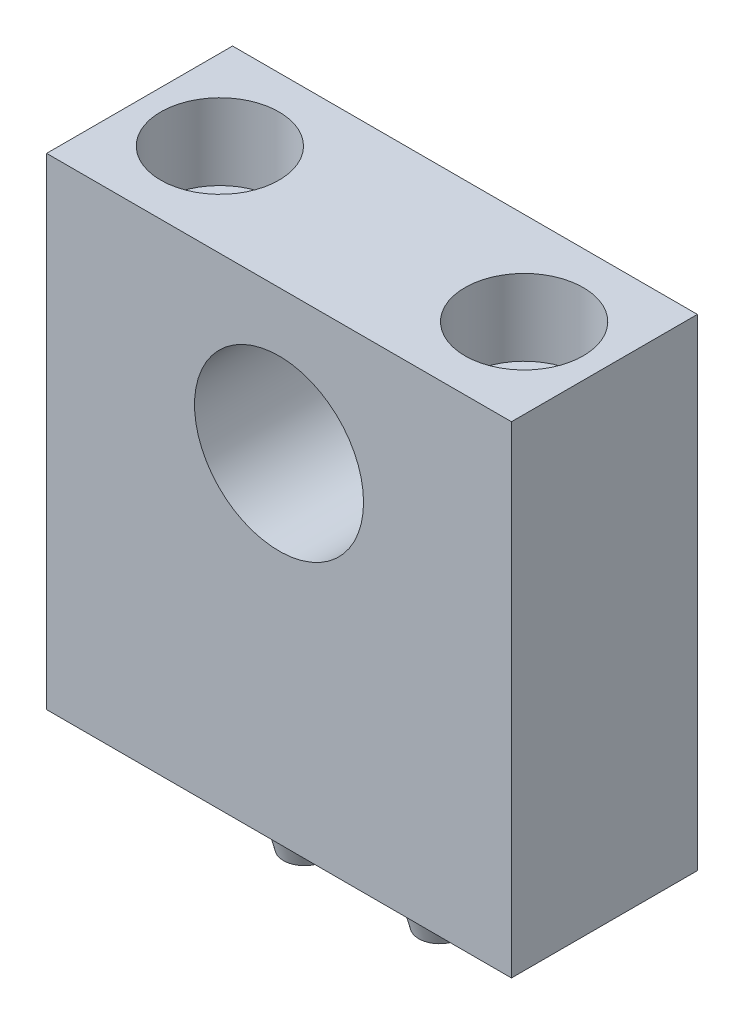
ISO-10303-21;
HEADER;
FILE_DESCRIPTION(('STEP AP214'),'2;1');
FILE_NAME('part.step','',(''),(''),'','','');
FILE_SCHEMA(('AUTOMOTIVE_DESIGN { 1 0 10303 214 1 1 1 1 }'));
ENDSEC;
DATA;
#1=APPLICATION_CONTEXT('core data for automotive mechanical design processes');
#2=APPLICATION_PROTOCOL_DEFINITION('international standard','automotive_design',2000,#1);
#3=PRODUCT_CONTEXT('',#1,'mechanical');
#4=PRODUCT('Part','Part','',(#3));
#5=PRODUCT_RELATED_PRODUCT_CATEGORY('part','',(#4));
#6=PRODUCT_DEFINITION_FORMATION('','',#4);
#7=PRODUCT_DEFINITION_CONTEXT('part definition',#1,'design');
#8=PRODUCT_DEFINITION('design','',#6,#7);
#9=PRODUCT_DEFINITION_SHAPE('','',#8);
#10=(LENGTH_UNIT() NAMED_UNIT(*) SI_UNIT(.MILLI.,.METRE.));
#11=(NAMED_UNIT(*) PLANE_ANGLE_UNIT() SI_UNIT($,.RADIAN.));
#12=(NAMED_UNIT(*) SI_UNIT($,.STERADIAN.) SOLID_ANGLE_UNIT());
#13=UNCERTAINTY_MEASURE_WITH_UNIT(LENGTH_MEASURE(1.E-05),#10,'distance_accuracy_value','');
#14=(GEOMETRIC_REPRESENTATION_CONTEXT(3) GLOBAL_UNCERTAINTY_ASSIGNED_CONTEXT((#13)) GLOBAL_UNIT_ASSIGNED_CONTEXT((#10,
#11,#12)) REPRESENTATION_CONTEXT('',''));
#15=CARTESIAN_POINT('',(0.,0.,0.));
#16=DIRECTION('',(0.,0.,1.));
#17=DIRECTION('',(1.,0.,0.));
#18=AXIS2_PLACEMENT_3D('',#15,#16,#17);
#19=CARTESIAN_POINT('',(-18.,57.,0.));
#20=DIRECTION('',(0.,-1.,0.));
#21=DIRECTION('',(0.,0.,-1.));
#22=AXIS2_PLACEMENT_3D('',#19,#20,#21);
#23=CYLINDRICAL_SURFACE('',#22,4.5);
#24=CARTESIAN_POINT('',(-18.,0.,0.));
#25=DIRECTION('',(0.,1.,0.));
#26=DIRECTION('',(0.,0.,1.));
#27=AXIS2_PLACEMENT_3D('',#24,#25,#26);
#28=CIRCLE('',#27,4.5);
#29=CARTESIAN_POINT('',(-18.,0.,4.5));
#30=VERTEX_POINT('',#29);
#31=EDGE_CURVE('E121',#30,#30,#28,.T.);
#32=ORIENTED_EDGE('',*,*,#31,.F.);
#33=EDGE_LOOP('',(#32));
#34=FACE_BOUND('',#33,.T.);
#35=CARTESIAN_POINT('',(-18.,48.,0.));
#36=DIRECTION('',(0.,1.,0.));
#37=DIRECTION('',(0.,0.,1.));
#38=AXIS2_PLACEMENT_3D('',#35,#36,#37);
#39=CIRCLE('',#38,4.5);
#40=CARTESIAN_POINT('',(-18.,48.,4.5));
#41=VERTEX_POINT('',#40);
#42=EDGE_CURVE('E102',#41,#41,#39,.T.);
#43=ORIENTED_EDGE('',*,*,#42,.T.);
#44=EDGE_LOOP('',(#43));
#45=FACE_BOUND('',#44,.T.);
#46=ADVANCED_FACE('F17',(#34,#45),#23,.F.);
#47=CARTESIAN_POINT('',(18.,57.,0.));
#48=DIRECTION('',(0.,-1.,0.));
#49=DIRECTION('',(0.,0.,-1.));
#50=AXIS2_PLACEMENT_3D('',#47,#48,#49);
#51=CYLINDRICAL_SURFACE('',#50,4.5);
#52=CARTESIAN_POINT('',(18.,0.,0.));
#53=DIRECTION('',(0.,1.,0.));
#54=DIRECTION('',(0.,0.,1.));
#55=AXIS2_PLACEMENT_3D('',#52,#53,#54);
#56=CIRCLE('',#55,4.5);
#57=CARTESIAN_POINT('',(18.,0.,4.5));
#58=VERTEX_POINT('',#57);
#59=EDGE_CURVE('E115',#58,#58,#56,.T.);
#60=ORIENTED_EDGE('',*,*,#59,.F.);
#61=EDGE_LOOP('',(#60));
#62=FACE_BOUND('',#61,.T.);
#63=CARTESIAN_POINT('',(18.,48.,0.));
#64=DIRECTION('',(0.,1.,0.));
#65=DIRECTION('',(0.,0.,1.));
#66=AXIS2_PLACEMENT_3D('',#63,#64,#65);
#67=CIRCLE('',#66,4.5);
#68=CARTESIAN_POINT('',(18.,48.,4.5));
#69=VERTEX_POINT('',#68);
#70=EDGE_CURVE('E108',#69,#69,#67,.T.);
#71=ORIENTED_EDGE('',*,*,#70,.T.);
#72=EDGE_LOOP('',(#71));
#73=FACE_BOUND('',#72,.T.);
#74=ADVANCED_FACE('F207',(#62,#73),#51,.F.);
#75=CARTESIAN_POINT('',(0.,57.,0.));
#76=DIRECTION('',(0.,-1.,0.));
#77=DIRECTION('',(0.,0.,-1.));
#78=AXIS2_PLACEMENT_3D('',#75,#76,#77);
#79=PLANE('',#78);
#80=CARTESIAN_POINT('',(-18.,57.,0.));
#81=DIRECTION('',(0.,1.,0.));
#82=DIRECTION('',(0.,0.,1.));
#83=AXIS2_PLACEMENT_3D('',#80,#81,#82);
#84=CIRCLE('',#83,7.);
#85=CARTESIAN_POINT('',(-18.,57.,7.));
#86=VERTEX_POINT('',#85);
#87=EDGE_CURVE('E98',#86,#86,#84,.T.);
#88=ORIENTED_EDGE('',*,*,#87,.F.);
#89=EDGE_LOOP('',(#88));
#90=FACE_BOUND('',#89,.T.);
#91=CARTESIAN_POINT('',(18.,57.,0.));
#92=DIRECTION('',(0.,1.,0.));
#93=DIRECTION('',(0.,0.,1.));
#94=AXIS2_PLACEMENT_3D('',#91,#92,#93);
#95=CIRCLE('',#94,7.);
#96=CARTESIAN_POINT('',(18.,57.,7.));
#97=VERTEX_POINT('',#96);
#98=EDGE_CURVE('E109',#97,#97,#95,.T.);
#99=ORIENTED_EDGE('',*,*,#98,.F.);
#100=EDGE_LOOP('',(#99));
#101=FACE_BOUND('',#100,.T.);
#102=DIRECTION('',(0.,0.,-1.));
#103=VECTOR('',#102,1.);
#104=CARTESIAN_POINT('',(27.5,57.,11.));
#105=LINE('',#104,#103);
#106=CARTESIAN_POINT('',(27.5,57.,11.));
#107=VERTEX_POINT('',#106);
#108=CARTESIAN_POINT('',(27.5,57.,-11.));
#109=VERTEX_POINT('',#108);
#110=EDGE_CURVE('E125',#107,#109,#105,.T.);
#111=ORIENTED_EDGE('',*,*,#110,.T.);
#112=DIRECTION('',(-1.,0.,0.));
#113=VECTOR('',#112,1.);
#114=CARTESIAN_POINT('',(-27.5,57.,-11.));
#115=LINE('',#114,#113);
#116=CARTESIAN_POINT('',(-27.5,57.,-11.));
#117=VERTEX_POINT('',#116);
#118=EDGE_CURVE('E67',#109,#117,#115,.T.);
#119=ORIENTED_EDGE('',*,*,#118,.T.);
#120=DIRECTION('',(0.,0.,1.));
#121=VECTOR('',#120,1.);
#122=CARTESIAN_POINT('',(-27.5,57.,11.));
#123=LINE('',#122,#121);
#124=CARTESIAN_POINT('',(-27.5,57.,11.));
#125=VERTEX_POINT('',#124);
#126=EDGE_CURVE('E128',#117,#125,#123,.T.);
#127=ORIENTED_EDGE('',*,*,#126,.T.);
#128=DIRECTION('',(1.,0.,0.));
#129=VECTOR('',#128,1.);
#130=CARTESIAN_POINT('',(-27.5,57.,11.));
#131=LINE('',#130,#129);
#132=EDGE_CURVE('E35',#125,#107,#131,.T.);
#133=ORIENTED_EDGE('',*,*,#132,.T.);
#134=EDGE_LOOP('',(#111,#119,#127,#133));
#135=FACE_BOUND('',#134,.T.);
#136=ADVANCED_FACE('F214',(#90,#101,#135),#79,.F.);
#137=CARTESIAN_POINT('',(0.,0.,0.));
#138=DIRECTION('',(0.,-1.,0.));
#139=DIRECTION('',(0.,0.,-1.));
#140=AXIS2_PLACEMENT_3D('',#137,#138,#139);
#141=PLANE('',#140);
#142=CARTESIAN_POINT('',(8.,0.,0.));
#143=DIRECTION('',(0.,-1.,0.));
#144=DIRECTION('',(0.,0.,-1.));
#145=AXIS2_PLACEMENT_3D('',#142,#143,#144);
#146=CIRCLE('',#145,3.);
#147=CARTESIAN_POINT('',(8.,0.,-3.));
#148=VERTEX_POINT('',#147);
#149=EDGE_CURVE('E86',#148,#148,#146,.T.);
#150=ORIENTED_EDGE('',*,*,#149,.F.);
#151=EDGE_LOOP('',(#150));
#152=FACE_BOUND('',#151,.T.);
#153=CARTESIAN_POINT('',(-8.,0.,0.));
#154=DIRECTION('',(0.,-1.,0.));
#155=DIRECTION('',(0.,0.,-1.));
#156=AXIS2_PLACEMENT_3D('',#153,#154,#155);
#157=CIRCLE('',#156,3.);
#158=CARTESIAN_POINT('',(-8.,0.,-3.));
#159=VERTEX_POINT('',#158);
#160=EDGE_CURVE('E85',#159,#159,#157,.T.);
#161=ORIENTED_EDGE('',*,*,#160,.F.);
#162=EDGE_LOOP('',(#161));
#163=FACE_BOUND('',#162,.T.);
#164=ORIENTED_EDGE('',*,*,#31,.T.);
#165=EDGE_LOOP('',(#164));
#166=FACE_BOUND('',#165,.T.);
#167=DIRECTION('',(0.,0.,-1.));
#168=VECTOR('',#167,1.);
#169=CARTESIAN_POINT('',(27.5,0.,11.));
#170=LINE('',#169,#168);
#171=CARTESIAN_POINT('',(27.5,0.,11.));
#172=VERTEX_POINT('',#171);
#173=CARTESIAN_POINT('',(27.5,0.,-11.));
#174=VERTEX_POINT('',#173);
#175=EDGE_CURVE('E124',#172,#174,#170,.T.);
#176=ORIENTED_EDGE('',*,*,#175,.F.);
#177=DIRECTION('',(1.,0.,0.));
#178=VECTOR('',#177,1.);
#179=CARTESIAN_POINT('',(-27.5,0.,11.));
#180=LINE('',#179,#178);
#181=CARTESIAN_POINT('',(-27.5,0.,11.));
#182=VERTEX_POINT('',#181);
#183=EDGE_CURVE('E59',#182,#172,#180,.T.);
#184=ORIENTED_EDGE('',*,*,#183,.F.);
#185=DIRECTION('',(0.,0.,1.));
#186=VECTOR('',#185,1.);
#187=CARTESIAN_POINT('',(-27.5,0.,11.));
#188=LINE('',#187,#186);
#189=CARTESIAN_POINT('',(-27.5,0.,-11.));
#190=VERTEX_POINT('',#189);
#191=EDGE_CURVE('E53',#190,#182,#188,.T.);
#192=ORIENTED_EDGE('',*,*,#191,.F.);
#193=DIRECTION('',(-1.,0.,0.));
#194=VECTOR('',#193,1.);
#195=CARTESIAN_POINT('',(-27.5,0.,-11.));
#196=LINE('',#195,#194);
#197=EDGE_CURVE('E134',#174,#190,#196,.T.);
#198=ORIENTED_EDGE('',*,*,#197,.F.);
#199=EDGE_LOOP('',(#176,#184,#192,#198));
#200=FACE_BOUND('',#199,.T.);
#201=ORIENTED_EDGE('',*,*,#59,.T.);
#202=EDGE_LOOP('',(#201));
#203=FACE_BOUND('',#202,.T.);
#204=ADVANCED_FACE('F223',(#152,#163,#166,#200,#203),#141,.T.);
#205=CARTESIAN_POINT('',(27.5,57.,11.));
#206=DIRECTION('',(-1.,0.,0.));
#207=DIRECTION('',(0.,0.,1.));
#208=AXIS2_PLACEMENT_3D('',#205,#206,#207);
#209=PLANE('',#208);
#210=ORIENTED_EDGE('',*,*,#175,.T.);
#211=DIRECTION('',(0.,-1.,0.));
#212=VECTOR('',#211,1.);
#213=CARTESIAN_POINT('',(27.5,57.,-11.));
#214=LINE('',#213,#212);
#215=EDGE_CURVE('E143',#109,#174,#214,.T.);
#216=ORIENTED_EDGE('',*,*,#215,.F.);
#217=ORIENTED_EDGE('',*,*,#110,.F.);
#218=DIRECTION('',(0.,-1.,0.));
#219=VECTOR('',#218,1.);
#220=CARTESIAN_POINT('',(27.5,57.,11.));
#221=LINE('',#220,#219);
#222=EDGE_CURVE('E131',#107,#172,#221,.T.);
#223=ORIENTED_EDGE('',*,*,#222,.T.);
#224=EDGE_LOOP('',(#210,#216,#217,#223));
#225=FACE_BOUND('',#224,.T.);
#226=ADVANCED_FACE('F19',(#225),#209,.F.);
#227=CARTESIAN_POINT('',(-27.5,57.,-11.));
#228=DIRECTION('',(0.,0.,1.));
#229=DIRECTION('',(1.,0.,0.));
#230=AXIS2_PLACEMENT_3D('',#227,#228,#229);
#231=PLANE('',#230);
#232=CARTESIAN_POINT('',(0.,40.,-11.));
#233=DIRECTION('',(0.,0.,1.));
#234=DIRECTION('',(1.,0.,0.));
#235=AXIS2_PLACEMENT_3D('',#232,#233,#234);
#236=CIRCLE('',#235,10.);
#237=CARTESIAN_POINT('',(10.,40.,-11.));
#238=VERTEX_POINT('',#237);
#239=EDGE_CURVE('E112',#238,#238,#236,.T.);
#240=ORIENTED_EDGE('',*,*,#239,.T.);
#241=EDGE_LOOP('',(#240));
#242=FACE_BOUND('',#241,.T.);
#243=ORIENTED_EDGE('',*,*,#197,.T.);
#244=DIRECTION('',(0.,-1.,0.));
#245=VECTOR('',#244,1.);
#246=CARTESIAN_POINT('',(-27.5,57.,-11.));
#247=LINE('',#246,#245);
#248=EDGE_CURVE('E141',#117,#190,#247,.T.);
#249=ORIENTED_EDGE('',*,*,#248,.F.);
#250=ORIENTED_EDGE('',*,*,#118,.F.);
#251=ORIENTED_EDGE('',*,*,#215,.T.);
#252=EDGE_LOOP('',(#243,#249,#250,#251));
#253=FACE_BOUND('',#252,.T.);
#254=ADVANCED_FACE('F235',(#242,#253),#231,.F.);
#255=CARTESIAN_POINT('',(-27.5,57.,11.));
#256=DIRECTION('',(1.,0.,0.));
#257=DIRECTION('',(0.,0.,-1.));
#258=AXIS2_PLACEMENT_3D('',#255,#256,#257);
#259=PLANE('',#258);
#260=ORIENTED_EDGE('',*,*,#191,.T.);
#261=DIRECTION('',(0.,-1.,0.));
#262=VECTOR('',#261,1.);
#263=CARTESIAN_POINT('',(-27.5,57.,11.));
#264=LINE('',#263,#262);
#265=EDGE_CURVE('E139',#125,#182,#264,.T.);
#266=ORIENTED_EDGE('',*,*,#265,.F.);
#267=ORIENTED_EDGE('',*,*,#126,.F.);
#268=ORIENTED_EDGE('',*,*,#248,.T.);
#269=EDGE_LOOP('',(#260,#266,#267,#268));
#270=FACE_BOUND('',#269,.T.);
#271=ADVANCED_FACE('F232',(#270),#259,.F.);
#272=CARTESIAN_POINT('',(-27.5,57.,11.));
#273=DIRECTION('',(0.,0.,-1.));
#274=DIRECTION('',(-1.,0.,0.));
#275=AXIS2_PLACEMENT_3D('',#272,#273,#274);
#276=PLANE('',#275);
#277=CARTESIAN_POINT('',(0.,40.,11.));
#278=DIRECTION('',(0.,0.,1.));
#279=DIRECTION('',(1.,0.,0.));
#280=AXIS2_PLACEMENT_3D('',#277,#278,#279);
#281=CIRCLE('',#280,10.);
#282=CARTESIAN_POINT('',(10.,40.,11.));
#283=VERTEX_POINT('',#282);
#284=EDGE_CURVE('E116',#283,#283,#281,.T.);
#285=ORIENTED_EDGE('',*,*,#284,.F.);
#286=EDGE_LOOP('',(#285));
#287=FACE_BOUND('',#286,.T.);
#288=ORIENTED_EDGE('',*,*,#183,.T.);
#289=ORIENTED_EDGE('',*,*,#222,.F.);
#290=ORIENTED_EDGE('',*,*,#132,.F.);
#291=ORIENTED_EDGE('',*,*,#265,.T.);
#292=EDGE_LOOP('',(#288,#289,#290,#291));
#293=FACE_BOUND('',#292,.T.);
#294=ADVANCED_FACE('F228',(#287,#293),#276,.F.);
#295=CARTESIAN_POINT('',(0.,40.,-11.));
#296=DIRECTION('',(0.,0.,1.));
#297=DIRECTION('',(1.,0.,0.));
#298=AXIS2_PLACEMENT_3D('',#295,#296,#297);
#299=CYLINDRICAL_SURFACE('',#298,10.);
#300=ORIENTED_EDGE('',*,*,#239,.F.);
#301=EDGE_LOOP('',(#300));
#302=FACE_BOUND('',#301,.T.);
#303=ORIENTED_EDGE('',*,*,#284,.T.);
#304=EDGE_LOOP('',(#303));
#305=FACE_BOUND('',#304,.T.);
#306=ADVANCED_FACE('F231',(#302,#305),#299,.F.);
#307=CARTESIAN_POINT('',(18.,48.,0.));
#308=DIRECTION('',(0.,1.,0.));
#309=DIRECTION('',(0.,0.,1.));
#310=AXIS2_PLACEMENT_3D('',#307,#308,#309);
#311=CYLINDRICAL_SURFACE('',#310,7.);
#312=CARTESIAN_POINT('',(18.,48.,0.));
#313=DIRECTION('',(0.,1.,0.));
#314=DIRECTION('',(0.,0.,1.));
#315=AXIS2_PLACEMENT_3D('',#312,#313,#314);
#316=CIRCLE('',#315,7.);
#317=CARTESIAN_POINT('',(18.,48.,7.));
#318=VERTEX_POINT('',#317);
#319=EDGE_CURVE('E105',#318,#318,#316,.T.);
#320=ORIENTED_EDGE('',*,*,#319,.F.);
#321=EDGE_LOOP('',(#320));
#322=FACE_BOUND('',#321,.T.);
#323=ORIENTED_EDGE('',*,*,#98,.T.);
#324=EDGE_LOOP('',(#323));
#325=FACE_BOUND('',#324,.T.);
#326=ADVANCED_FACE('F258',(#322,#325),#311,.F.);
#327=CARTESIAN_POINT('',(18.,48.,0.));
#328=DIRECTION('',(0.,1.,0.));
#329=DIRECTION('',(0.,0.,1.));
#330=AXIS2_PLACEMENT_3D('',#327,#328,#329);
#331=PLANE('',#330);
#332=ORIENTED_EDGE('',*,*,#70,.F.);
#333=EDGE_LOOP('',(#332));
#334=FACE_BOUND('',#333,.T.);
#335=ORIENTED_EDGE('',*,*,#319,.T.);
#336=EDGE_LOOP('',(#335));
#337=FACE_BOUND('',#336,.T.);
#338=ADVANCED_FACE('F254',(#334,#337),#331,.T.);
#339=CARTESIAN_POINT('',(-18.,48.,0.));
#340=DIRECTION('',(0.,1.,0.));
#341=DIRECTION('',(0.,0.,1.));
#342=AXIS2_PLACEMENT_3D('',#339,#340,#341);
#343=CYLINDRICAL_SURFACE('',#342,7.);
#344=CARTESIAN_POINT('',(-18.,48.,0.));
#345=DIRECTION('',(0.,1.,0.));
#346=DIRECTION('',(0.,0.,1.));
#347=AXIS2_PLACEMENT_3D('',#344,#345,#346);
#348=CIRCLE('',#347,7.);
#349=CARTESIAN_POINT('',(-18.,48.,7.));
#350=VERTEX_POINT('',#349);
#351=EDGE_CURVE('E99',#350,#350,#348,.T.);
#352=ORIENTED_EDGE('',*,*,#351,.F.);
#353=EDGE_LOOP('',(#352));
#354=FACE_BOUND('',#353,.T.);
#355=ORIENTED_EDGE('',*,*,#87,.T.);
#356=EDGE_LOOP('',(#355));
#357=FACE_BOUND('',#356,.T.);
#358=ADVANCED_FACE('F257',(#354,#357),#343,.F.);
#359=CARTESIAN_POINT('',(-18.,48.,0.));
#360=DIRECTION('',(0.,1.,0.));
#361=DIRECTION('',(0.,0.,1.));
#362=AXIS2_PLACEMENT_3D('',#359,#360,#361);
#363=PLANE('',#362);
#364=ORIENTED_EDGE('',*,*,#42,.F.);
#365=EDGE_LOOP('',(#364));
#366=FACE_BOUND('',#365,.T.);
#367=ORIENTED_EDGE('',*,*,#351,.T.);
#368=EDGE_LOOP('',(#367));
#369=FACE_BOUND('',#368,.T.);
#370=ADVANCED_FACE('F202',(#366,#369),#363,.T.);
#371=CARTESIAN_POINT('',(-8.,20.,0.));
#372=DIRECTION('',(0.,1.,0.));
#373=DIRECTION('',(0.,0.,1.));
#374=AXIS2_PLACEMENT_3D('',#371,#372,#373);
#375=CYLINDRICAL_SURFACE('',#374,3.);
#376=ORIENTED_EDGE('',*,*,#160,.T.);
#377=EDGE_LOOP('',(#376));
#378=FACE_BOUND('',#377,.T.);
#379=CARTESIAN_POINT('',(-8.,-8.,0.));
#380=DIRECTION('',(0.,1.,0.));
#381=DIRECTION('',(0.,0.,1.));
#382=AXIS2_PLACEMENT_3D('',#379,#380,#381);
#383=CIRCLE('',#382,3.);
#384=CARTESIAN_POINT('',(-8.,-8.,3.));
#385=VERTEX_POINT('',#384);
#386=EDGE_CURVE('E92',#385,#385,#383,.T.);
#387=ORIENTED_EDGE('',*,*,#386,.T.);
#388=EDGE_LOOP('',(#387));
#389=FACE_BOUND('',#388,.T.);
#390=ADVANCED_FACE('F177',(#378,#389),#375,.T.);
#391=CARTESIAN_POINT('',(-8.,-10.,0.));
#392=DIRECTION('',(0.,1.,0.));
#393=DIRECTION('',(0.,0.,1.));
#394=AXIS2_PLACEMENT_3D('',#391,#392,#393);
#395=CONICAL_SURFACE('',#394,2.46410161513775,0.26179938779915);
#396=ORIENTED_EDGE('',*,*,#386,.F.);
#397=EDGE_LOOP('',(#396));
#398=FACE_BOUND('',#397,.T.);
#399=CARTESIAN_POINT('',(-8.,-10.,0.));
#400=DIRECTION('',(0.,1.,0.));
#401=DIRECTION('',(0.,0.,1.));
#402=AXIS2_PLACEMENT_3D('',#399,#400,#401);
#403=CIRCLE('',#402,2.46410161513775);
#404=CARTESIAN_POINT('',(-8.,-10.,2.46410161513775));
#405=VERTEX_POINT('',#404);
#406=EDGE_CURVE('E452',#405,#405,#403,.T.);
#407=ORIENTED_EDGE('',*,*,#406,.T.);
#408=EDGE_LOOP('',(#407));
#409=FACE_BOUND('',#408,.T.);
#410=ADVANCED_FACE('F195',(#398,#409),#395,.T.);
#411=CARTESIAN_POINT('',(-8.,-10.,0.));
#412=DIRECTION('',(0.,1.,0.));
#413=DIRECTION('',(0.,0.,1.));
#414=AXIS2_PLACEMENT_3D('',#411,#412,#413);
#415=PLANE('',#414);
#416=ORIENTED_EDGE('',*,*,#406,.F.);
#417=EDGE_LOOP('',(#416));
#418=FACE_BOUND('',#417,.T.);
#419=ADVANCED_FACE('F193',(#418),#415,.F.);
#420=CARTESIAN_POINT('',(8.,20.,0.));
#421=DIRECTION('',(0.,1.,0.));
#422=DIRECTION('',(0.,0.,1.));
#423=AXIS2_PLACEMENT_3D('',#420,#421,#422);
#424=CYLINDRICAL_SURFACE('',#423,3.);
#425=ORIENTED_EDGE('',*,*,#149,.T.);
#426=EDGE_LOOP('',(#425));
#427=FACE_BOUND('',#426,.T.);
#428=CARTESIAN_POINT('',(8.,-8.,0.));
#429=DIRECTION('',(0.,1.,0.));
#430=DIRECTION('',(0.,0.,1.));
#431=AXIS2_PLACEMENT_3D('',#428,#429,#430);
#432=CIRCLE('',#431,3.);
#433=CARTESIAN_POINT('',(8.,-8.,3.));
#434=VERTEX_POINT('',#433);
#435=EDGE_CURVE('E449',#434,#434,#432,.T.);
#436=ORIENTED_EDGE('',*,*,#435,.T.);
#437=EDGE_LOOP('',(#436));
#438=FACE_BOUND('',#437,.T.);
#439=ADVANCED_FACE('F191',(#427,#438),#424,.T.);
#440=CARTESIAN_POINT('',(8.,-10.,0.));
#441=DIRECTION('',(0.,1.,0.));
#442=DIRECTION('',(0.,0.,1.));
#443=AXIS2_PLACEMENT_3D('',#440,#441,#442);
#444=CONICAL_SURFACE('',#443,2.46410161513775,0.26179938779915);
#445=ORIENTED_EDGE('',*,*,#435,.F.);
#446=EDGE_LOOP('',(#445));
#447=FACE_BOUND('',#446,.T.);
#448=CARTESIAN_POINT('',(8.,-10.,0.));
#449=DIRECTION('',(0.,1.,0.));
#450=DIRECTION('',(0.,0.,1.));
#451=AXIS2_PLACEMENT_3D('',#448,#449,#450);
#452=CIRCLE('',#451,2.46410161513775);
#453=CARTESIAN_POINT('',(8.,-10.,2.46410161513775));
#454=VERTEX_POINT('',#453);
#455=EDGE_CURVE('E447',#454,#454,#452,.T.);
#456=ORIENTED_EDGE('',*,*,#455,.T.);
#457=EDGE_LOOP('',(#456));
#458=FACE_BOUND('',#457,.T.);
#459=ADVANCED_FACE('F321',(#447,#458),#444,.T.);
#460=CARTESIAN_POINT('',(8.,-10.,0.));
#461=DIRECTION('',(0.,1.,0.));
#462=DIRECTION('',(0.,0.,1.));
#463=AXIS2_PLACEMENT_3D('',#460,#461,#462);
#464=PLANE('',#463);
#465=ORIENTED_EDGE('',*,*,#455,.F.);
#466=EDGE_LOOP('',(#465));
#467=FACE_BOUND('',#466,.T.);
#468=ADVANCED_FACE('F331',(#467),#464,.F.);
#469=CLOSED_SHELL('',(#46,#74,#136,#204,#226,#254,#271,#294,#306,#326,#338,#358,#370,#390,#410,
#419,#439,#459,#468));
#470=CARTESIAN_POINT('',(8.,4.,0.));
#471=DIRECTION('',(0.,1.,0.));
#472=DIRECTION('',(0.,0.,-1.));
#473=AXIS2_PLACEMENT_3D('',#470,#471,#472);
#474=SPHERICAL_SURFACE('',#473,6.);
#475=CARTESIAN_POINT('',(8.,9.19615242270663,0.));
#476=DIRECTION('',(0.,-1.,0.));
#477=DIRECTION('',(0.,0.,-1.));
#478=AXIS2_PLACEMENT_3D('',#475,#476,#477);
#479=CIRCLE('',#478,3.);
#480=CARTESIAN_POINT('',(8.,9.19615242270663,-3.));
#481=VERTEX_POINT('',#480);
#482=EDGE_CURVE('E10',#481,#481,#479,.F.);
#483=ORIENTED_EDGE('',*,*,#482,.T.);
#484=EDGE_LOOP('',(#483));
#485=FACE_BOUND('',#484,.T.);
#486=ADVANCED_FACE('F78',(#485),#474,.T.);
#487=CARTESIAN_POINT('',(8.,12.,0.));
#488=DIRECTION('',(0.,-1.,0.));
#489=DIRECTION('',(0.,0.,-1.));
#490=AXIS2_PLACEMENT_3D('',#487,#488,#489);
#491=CONICAL_SURFACE('',#490,3.,1.02974425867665);
#492=CARTESIAN_POINT('',(8.,13.8025818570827,0.));
#493=VERTEX_POINT('',#492);
#494=VERTEX_LOOP('',#493);
#495=FACE_BOUND('',#494,.T.);
#496=CARTESIAN_POINT('',(8.,12.,0.));
#497=DIRECTION('',(0.,-1.,0.));
#498=DIRECTION('',(0.,0.,-1.));
#499=AXIS2_PLACEMENT_3D('',#496,#497,#498);
#500=CIRCLE('',#499,3.);
#501=CARTESIAN_POINT('',(8.,12.,-3.));
#502=VERTEX_POINT('',#501);
#503=EDGE_CURVE('E83',#502,#502,#500,.T.);
#504=ORIENTED_EDGE('',*,*,#503,.T.);
#505=EDGE_LOOP('',(#504));
#506=FACE_BOUND('',#505,.T.);
#507=ADVANCED_FACE('F74',(#495,#506),#491,.F.);
#508=CARTESIAN_POINT('',(8.,0.,0.));
#509=DIRECTION('',(0.,-1.,0.));
#510=DIRECTION('',(0.,0.,-1.));
#511=AXIS2_PLACEMENT_3D('',#508,#509,#510);
#512=CYLINDRICAL_SURFACE('',#511,3.);
#513=ORIENTED_EDGE('',*,*,#503,.F.);
#514=EDGE_LOOP('',(#513));
#515=FACE_BOUND('',#514,.T.);
#516=ORIENTED_EDGE('',*,*,#482,.F.);
#517=EDGE_LOOP('',(#516));
#518=FACE_BOUND('',#517,.T.);
#519=ADVANCED_FACE('F77',(#515,#518),#512,.F.);
#520=CLOSED_SHELL('',(#486,#507,#519));
#521=CARTESIAN_POINT('',(-8.,4.,0.));
#522=DIRECTION('',(0.,1.,0.));
#523=DIRECTION('',(0.,0.,-1.));
#524=AXIS2_PLACEMENT_3D('',#521,#522,#523);
#525=SPHERICAL_SURFACE('',#524,6.);
#526=CARTESIAN_POINT('',(-8.,9.19615242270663,0.));
#527=DIRECTION('',(0.,-1.,0.));
#528=DIRECTION('',(0.,0.,-1.));
#529=AXIS2_PLACEMENT_3D('',#526,#527,#528);
#530=CIRCLE('',#529,3.);
#531=CARTESIAN_POINT('',(-8.,9.19615242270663,-3.));
#532=VERTEX_POINT('',#531);
#533=EDGE_CURVE('E27',#532,#532,#530,.F.);
#534=ORIENTED_EDGE('',*,*,#533,.T.);
#535=EDGE_LOOP('',(#534));
#536=FACE_BOUND('',#535,.T.);
#537=ADVANCED_FACE('F151',(#536),#525,.T.);
#538=CARTESIAN_POINT('',(-8.,12.,0.));
#539=DIRECTION('',(0.,-1.,0.));
#540=DIRECTION('',(0.,0.,-1.));
#541=AXIS2_PLACEMENT_3D('',#538,#539,#540);
#542=CONICAL_SURFACE('',#541,3.,1.02974425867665);
#543=CARTESIAN_POINT('',(-8.,13.8025818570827,0.));
#544=VERTEX_POINT('',#543);
#545=VERTEX_LOOP('',#544);
#546=FACE_BOUND('',#545,.T.);
#547=CARTESIAN_POINT('',(-8.,12.,0.));
#548=DIRECTION('',(0.,-1.,0.));
#549=DIRECTION('',(0.,0.,-1.));
#550=AXIS2_PLACEMENT_3D('',#547,#548,#549);
#551=CIRCLE('',#550,3.);
#552=CARTESIAN_POINT('',(-8.,12.,-3.));
#553=VERTEX_POINT('',#552);
#554=EDGE_CURVE('E89',#553,#553,#551,.T.);
#555=ORIENTED_EDGE('',*,*,#554,.T.);
#556=EDGE_LOOP('',(#555));
#557=FACE_BOUND('',#556,.T.);
#558=ADVANCED_FACE('F155',(#546,#557),#542,.F.);
#559=CARTESIAN_POINT('',(-8.,0.,0.));
#560=DIRECTION('',(0.,-1.,0.));
#561=DIRECTION('',(0.,0.,-1.));
#562=AXIS2_PLACEMENT_3D('',#559,#560,#561);
#563=CYLINDRICAL_SURFACE('',#562,3.);
#564=ORIENTED_EDGE('',*,*,#554,.F.);
#565=EDGE_LOOP('',(#564));
#566=FACE_BOUND('',#565,.T.);
#567=ORIENTED_EDGE('',*,*,#533,.F.);
#568=EDGE_LOOP('',(#567));
#569=FACE_BOUND('',#568,.T.);
#570=ADVANCED_FACE('F153',(#566,#569),#563,.F.);
#571=CLOSED_SHELL('',(#537,#558,#570));
#572=ORIENTED_CLOSED_SHELL('',*,#520,.T.);
#573=ORIENTED_CLOSED_SHELL('',*,#571,.T.);
#574=BREP_WITH_VOIDS('B1',#469,(#572,#573));
#575=ADVANCED_BREP_SHAPE_REPRESENTATION('',(#18,#574),#14);
#576=SHAPE_DEFINITION_REPRESENTATION(#9,#575);
ENDSEC;
END-ISO-10303-21;
